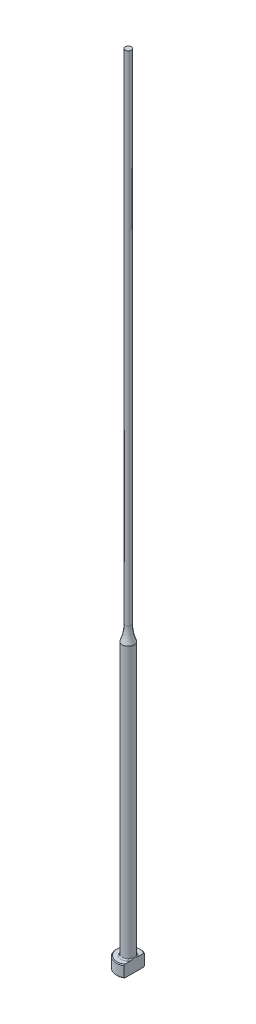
ISO-10303-21;
HEADER;
FILE_DESCRIPTION(('STEP AP214'),'2;1');
FILE_NAME('part.step','',(''),(''),'','','');
FILE_SCHEMA(('AUTOMOTIVE_DESIGN { 1 0 10303 214 1 1 1 1 }'));
ENDSEC;
DATA;
#1=APPLICATION_CONTEXT('core data for automotive mechanical design processes');
#2=APPLICATION_PROTOCOL_DEFINITION('international standard','automotive_design',2000,#1);
#3=PRODUCT_CONTEXT('',#1,'mechanical');
#4=PRODUCT('Part','Part','',(#3));
#5=PRODUCT_RELATED_PRODUCT_CATEGORY('part','',(#4));
#6=PRODUCT_DEFINITION_FORMATION('','',#4);
#7=PRODUCT_DEFINITION_CONTEXT('part definition',#1,'design');
#8=PRODUCT_DEFINITION('design','',#6,#7);
#9=PRODUCT_DEFINITION_SHAPE('','',#8);
#10=(LENGTH_UNIT() NAMED_UNIT(*) SI_UNIT(.MILLI.,.METRE.));
#11=(NAMED_UNIT(*) PLANE_ANGLE_UNIT() SI_UNIT($,.RADIAN.));
#12=(NAMED_UNIT(*) SI_UNIT($,.STERADIAN.) SOLID_ANGLE_UNIT());
#13=UNCERTAINTY_MEASURE_WITH_UNIT(LENGTH_MEASURE(1.E-05),#10,'distance_accuracy_value','');
#14=(GEOMETRIC_REPRESENTATION_CONTEXT(3) GLOBAL_UNCERTAINTY_ASSIGNED_CONTEXT((#13)) GLOBAL_UNIT_ASSIGNED_CONTEXT((#10,
#11,#12)) REPRESENTATION_CONTEXT('',''));
#15=CARTESIAN_POINT('',(0.,0.,0.));
#16=DIRECTION('',(0.,0.,1.));
#17=DIRECTION('',(1.,0.,0.));
#18=AXIS2_PLACEMENT_3D('',#15,#16,#17);
#19=CARTESIAN_POINT('',(-2.99999999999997,3.,0.));
#20=DIRECTION('',(0.,1.,0.));
#21=DIRECTION('',(0.,0.,1.));
#22=AXIS2_PLACEMENT_3D('',#19,#20,#21);
#23=PLANE('',#22);
#24=CARTESIAN_POINT('',(0.,3.,0.));
#25=DIRECTION('',(0.,1.,0.));
#26=DIRECTION('',(0.,0.,1.));
#27=AXIS2_PLACEMENT_3D('',#24,#25,#26);
#28=CIRCLE('',#27,2.79999999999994);
#29=CARTESIAN_POINT('',(1.49999999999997,3.,-2.36431808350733));
#30=VERTEX_POINT('',#29);
#31=CARTESIAN_POINT('',(1.49999999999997,3.,2.36431808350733));
#32=VERTEX_POINT('',#31);
#33=EDGE_CURVE('E187',#30,#32,#28,.T.);
#34=ORIENTED_EDGE('',*,*,#33,.T.);
#35=DIRECTION('',(0.,0.,-1.));
#36=VECTOR('',#35,1.);
#37=CARTESIAN_POINT('',(1.49999999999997,3.,0.));
#38=LINE('',#37,#36);
#39=CARTESIAN_POINT('',(1.49999999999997,3.00000000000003,0.99498743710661));
#40=VERTEX_POINT('',#39);
#41=EDGE_CURVE('E57',#32,#40,#38,.T.);
#42=ORIENTED_EDGE('',*,*,#41,.T.);
#43=CARTESIAN_POINT('',(0.,3.,0.));
#44=DIRECTION('',(0.,1.,0.));
#45=DIRECTION('',(0.,0.,1.));
#46=AXIS2_PLACEMENT_3D('',#43,#44,#45);
#47=CIRCLE('',#46,1.79999999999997);
#48=CARTESIAN_POINT('',(1.49999999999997,3.00000000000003,-0.994987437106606));
#49=VERTEX_POINT('',#48);
#50=EDGE_CURVE('E108',#40,#49,#47,.F.);
#51=ORIENTED_EDGE('',*,*,#50,.T.);
#52=EDGE_CURVE('E137',#49,#30,#38,.T.);
#53=ORIENTED_EDGE('',*,*,#52,.T.);
#54=EDGE_LOOP('',(#34,#42,#51,#53));
#55=FACE_BOUND('',#54,.T.);
#56=ADVANCED_FACE('F32',(#55),#23,.T.);
#57=CARTESIAN_POINT('',(0.,259.958771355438,0.));
#58=DIRECTION('',(0.,1.,0.));
#59=DIRECTION('',(0.,0.,1.));
#60=AXIS2_PLACEMENT_3D('',#57,#58,#59);
#61=CYLINDRICAL_SURFACE('',#60,2.99999999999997);
#62=CARTESIAN_POINT('',(0.,2.79999999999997,0.));
#63=DIRECTION('',(0.,1.,0.));
#64=DIRECTION('',(0.,0.,1.));
#65=AXIS2_PLACEMENT_3D('',#62,#63,#64);
#66=CIRCLE('',#65,2.99999999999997);
#67=CARTESIAN_POINT('',(1.49999999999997,2.79999999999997,2.5980762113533));
#68=VERTEX_POINT('',#67);
#69=CARTESIAN_POINT('',(1.49999999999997,2.79999999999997,-2.5980762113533));
#70=VERTEX_POINT('',#69);
#71=EDGE_CURVE('E105',#68,#70,#66,.F.);
#72=ORIENTED_EDGE('',*,*,#71,.T.);
#73=DIRECTION('',(0.,-1.,0.));
#74=VECTOR('',#73,1.);
#75=CARTESIAN_POINT('',(1.49999999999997,200.,-2.5980762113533));
#76=LINE('',#75,#74);
#77=CARTESIAN_POINT('',(1.49999999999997,0.200000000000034,-2.5980762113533));
#78=VERTEX_POINT('',#77);
#79=EDGE_CURVE('E193',#70,#78,#76,.T.);
#80=ORIENTED_EDGE('',*,*,#79,.T.);
#81=CARTESIAN_POINT('',(0.,0.200000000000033,0.));
#82=DIRECTION('',(0.,-1.,0.));
#83=DIRECTION('',(0.,0.,-1.));
#84=AXIS2_PLACEMENT_3D('',#81,#82,#83);
#85=CIRCLE('',#84,2.99999999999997);
#86=CARTESIAN_POINT('',(1.49999999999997,0.200000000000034,2.5980762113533));
#87=VERTEX_POINT('',#86);
#88=EDGE_CURVE('E100',#78,#87,#85,.F.);
#89=ORIENTED_EDGE('',*,*,#88,.T.);
#90=DIRECTION('',(0.,-1.,0.));
#91=VECTOR('',#90,1.);
#92=CARTESIAN_POINT('',(1.49999999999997,200.,2.5980762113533));
#93=LINE('',#92,#91);
#94=EDGE_CURVE('E93',#68,#87,#93,.T.);
#95=ORIENTED_EDGE('',*,*,#94,.F.);
#96=EDGE_LOOP('',(#72,#80,#89,#95));
#97=FACE_BOUND('',#96,.T.);
#98=ADVANCED_FACE('F158',(#97),#61,.T.);
#99=CARTESIAN_POINT('',(0.,0.,0.));
#100=DIRECTION('',(0.,-1.,0.));
#101=DIRECTION('',(0.,0.,-1.));
#102=AXIS2_PLACEMENT_3D('',#99,#100,#101);
#103=PLANE('',#102);
#104=CARTESIAN_POINT('',(0.,0.,0.));
#105=DIRECTION('',(0.,-1.,0.));
#106=DIRECTION('',(0.,0.,-1.));
#107=AXIS2_PLACEMENT_3D('',#104,#105,#106);
#108=CIRCLE('',#107,2.79999999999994);
#109=CARTESIAN_POINT('',(1.49999999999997,0.,2.36431808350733));
#110=VERTEX_POINT('',#109);
#111=CARTESIAN_POINT('',(1.49999999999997,0.,-2.36431808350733));
#112=VERTEX_POINT('',#111);
#113=EDGE_CURVE('E98',#110,#112,#108,.T.);
#114=ORIENTED_EDGE('',*,*,#113,.T.);
#115=DIRECTION('',(0.,0.,1.));
#116=VECTOR('',#115,1.);
#117=CARTESIAN_POINT('',(1.49999999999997,0.,-2.5980762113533));
#118=LINE('',#117,#116);
#119=EDGE_CURVE('E83',#112,#110,#118,.T.);
#120=ORIENTED_EDGE('',*,*,#119,.T.);
#121=EDGE_LOOP('',(#114,#120));
#122=FACE_BOUND('',#121,.T.);
#123=ADVANCED_FACE('F103',(#122),#103,.T.);
#124=CARTESIAN_POINT('',(0.,3.,0.));
#125=DIRECTION('',(0.,-1.,0.));
#126=DIRECTION('',(0.,0.,-1.));
#127=AXIS2_PLACEMENT_3D('',#124,#125,#126);
#128=CONICAL_SURFACE('',#127,2.79999999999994,0.785398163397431);
#129=ORIENTED_EDGE('',*,*,#71,.F.);
#130=CARTESIAN_POINT('',(1.49999999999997,-0.11174109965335,5.71827621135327));
#131=CARTESIAN_POINT('',(1.49999999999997,0.0136183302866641,5.58866816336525));
#132=CARTESIAN_POINT('',(1.49999999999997,0.138843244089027,5.45892957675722));
#133=CARTESIAN_POINT('',(1.49999999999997,0.388944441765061,5.19911365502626));
#134=CARTESIAN_POINT('',(1.49999999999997,0.513820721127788,5.06903631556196));
#135=CARTESIAN_POINT('',(1.49999999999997,0.763205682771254,4.80840180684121));
#136=CARTESIAN_POINT('',(1.49999999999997,0.887714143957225,4.67784442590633));
#137=CARTESIAN_POINT('',(1.49999999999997,1.13618059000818,4.4162081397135));
#138=CARTESIAN_POINT('',(1.49999999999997,1.26013857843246,4.28512923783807));
#139=CARTESIAN_POINT('',(1.49999999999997,1.50488975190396,4.02490837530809));
#140=CARTESIAN_POINT('',(1.49999999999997,1.62569693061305,3.8957795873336));
#141=CARTESIAN_POINT('',(1.49999999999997,1.86640694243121,3.63668213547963));
#142=CARTESIAN_POINT('',(1.49999999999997,1.98630978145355,3.50671347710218));
#143=CARTESIAN_POINT('',(1.49999999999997,2.2248603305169,3.24567921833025));
#144=CARTESIAN_POINT('',(1.49999999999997,2.3435083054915,3.11461386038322));
#145=CARTESIAN_POINT('',(1.49999999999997,2.5790771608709,2.85094268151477));
#146=CARTESIAN_POINT('',(1.49999999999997,2.69599811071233,2.71833692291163));
#147=CARTESIAN_POINT('',(1.49999999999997,2.88262371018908,2.50255231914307));
#148=CARTESIAN_POINT('',(1.49999999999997,2.95312454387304,2.42006293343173));
#149=CARTESIAN_POINT('',(1.49999999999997,3.09287098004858,2.25401084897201));
#150=CARTESIAN_POINT('',(1.49999999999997,3.16211645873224,2.17044804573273));
#151=CARTESIAN_POINT('',(1.49999999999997,3.29964684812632,2.00105967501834));
#152=CARTESIAN_POINT('',(1.49999999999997,3.36791386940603,1.9152195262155));
#153=CARTESIAN_POINT('',(1.49999999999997,3.50205840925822,1.7417139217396));
#154=CARTESIAN_POINT('',(1.49999999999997,3.56793649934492,1.65404891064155));
#155=CARTESIAN_POINT('',(1.49999999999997,3.69728151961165,1.47490236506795));
#156=CARTESIAN_POINT('',(1.49999999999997,3.76069661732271,1.38338308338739));
#157=CARTESIAN_POINT('',(1.49999999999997,3.88239539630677,1.19675661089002));
#158=CARTESIAN_POINT('',(1.49999999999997,3.94067201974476,1.10164473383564));
#159=CARTESIAN_POINT('',(1.49999999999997,4.048413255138,0.908008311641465));
#160=CARTESIAN_POINT('',(1.49999999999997,4.09797809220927,0.809540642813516));
#161=CARTESIAN_POINT('',(1.49999999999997,4.18432188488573,0.60719295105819));
#162=CARTESIAN_POINT('',(1.49999999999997,4.22114374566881,0.503332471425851));
#163=CARTESIAN_POINT('',(1.49999999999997,4.26099935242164,0.3475775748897));
#164=CARTESIAN_POINT('',(1.49999999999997,4.2715702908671,0.297609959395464));
#165=CARTESIAN_POINT('',(1.49999999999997,4.28794860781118,0.196885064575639));
#166=CARTESIAN_POINT('',(1.49999999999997,4.29375640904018,0.146127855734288));
#167=CARTESIAN_POINT('',(1.49999999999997,4.30019707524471,0.0444388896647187));
#168=CARTESIAN_POINT('',(1.49999999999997,4.30084594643,-0.00649183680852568));
#169=CARTESIAN_POINT('',(1.49999999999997,4.29696416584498,-0.108155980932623));
#170=CARTESIAN_POINT('',(1.49999999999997,4.29243308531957,-0.158889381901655));
#171=CARTESIAN_POINT('',(1.49999999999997,4.27856915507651,-0.259234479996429));
#172=CARTESIAN_POINT('',(1.49999999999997,4.2692782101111,-0.308852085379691));
#173=CARTESIAN_POINT('',(1.49999999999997,4.24647108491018,-0.407110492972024));
#174=CARTESIAN_POINT('',(1.49999999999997,4.23295324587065,-0.45575090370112));
#175=CARTESIAN_POINT('',(1.49999999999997,4.20226175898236,-0.55214996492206));
#176=CARTESIAN_POINT('',(1.49999999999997,4.18506801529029,-0.599902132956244));
#177=CARTESIAN_POINT('',(1.49999999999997,4.14771387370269,-0.694205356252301));
#178=CARTESIAN_POINT('',(1.49999999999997,4.12755408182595,-0.740756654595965));
#179=CARTESIAN_POINT('',(1.49999999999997,4.0632769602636,-0.879166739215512));
#180=CARTESIAN_POINT('',(1.49999999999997,4.01551721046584,-0.969329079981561));
#181=CARTESIAN_POINT('',(1.49999999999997,3.91367909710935,-1.14604316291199));
#182=CARTESIAN_POINT('',(1.49999999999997,3.85959300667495,-1.2325903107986));
#183=CARTESIAN_POINT('',(1.49999999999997,3.74697968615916,-1.40321348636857));
#184=CARTESIAN_POINT('',(1.49999999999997,3.68843573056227,-1.4872783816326));
#185=CARTESIAN_POINT('',(1.49999999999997,3.5684384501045,-1.65322187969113));
#186=CARTESIAN_POINT('',(1.49999999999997,3.50698656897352,-1.73510153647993));
#187=CARTESIAN_POINT('',(1.49999999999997,3.3811567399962,-1.89829823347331));
#188=CARTESIAN_POINT('',(1.49999999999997,3.31675092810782,-1.97959369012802));
#189=CARTESIAN_POINT('',(1.49999999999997,3.18634068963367,-2.14090082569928));
#190=CARTESIAN_POINT('',(1.49999999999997,3.12033609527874,-2.22091236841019));
#191=CARTESIAN_POINT('',(1.49999999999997,2.92086431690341,-2.45906508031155));
#192=CARTESIAN_POINT('',(1.49999999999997,2.78562663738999,-2.61572090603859));
#193=CARTESIAN_POINT('',(1.49999999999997,2.53554498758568,-2.90006295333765));
#194=CARTESIAN_POINT('',(1.49999999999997,2.42114543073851,-3.02814382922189));
#195=CARTESIAN_POINT('',(1.49999999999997,2.1909355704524,-3.28303767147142));
#196=CARTESIAN_POINT('',(1.49999999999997,2.07512522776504,-3.40985060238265));
#197=CARTESIAN_POINT('',(1.49999999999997,1.72597067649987,-3.78913849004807));
#198=CARTESIAN_POINT('',(1.49999999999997,1.49111760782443,-4.04022177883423));
#199=CARTESIAN_POINT('',(1.49999999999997,1.0288247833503,-4.52992803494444));
#200=CARTESIAN_POINT('',(1.49999999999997,0.801477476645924,-4.76863870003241));
#201=CARTESIAN_POINT('',(1.49999999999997,0.459548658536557,-5.12558036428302));
#202=CARTESIAN_POINT('',(1.49999999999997,0.345484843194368,-5.24430773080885));
#203=CARTESIAN_POINT('',(1.49999999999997,0.117071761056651,-5.48148573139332));
#204=CARTESIAN_POINT('',(1.49999999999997,0.00272249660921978,-5.59993636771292));
#205=CARTESIAN_POINT('',(1.49999999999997,-0.11174109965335,-5.71827621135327));
#206=B_SPLINE_CURVE_WITH_KNOTS('',3,(#130,#131,#132,#133,#134,#135,#136,#137,#138,#139,#140,
#141,#142,#143,#144,#145,#146,#147,#148,#149,#150,#151,#152,#153,#154,#155,#156,#157,#158,#159,
#160,#161,#162,#163,#164,#165,#166,#167,#168,#169,#170,#171,#172,#173,#174,#175,#176,#177,#178,
#179,#180,#181,#182,#183,#184,#185,#186,#187,#188,#189,#190,#191,#192,#193,#194,#195,#196,#197,
#198,#199,#200,#201,#202,#203,#204,#205),.UNSPECIFIED.,.F.,.F.,(4,2,2,2,2,2,2,2,2,2,2,2,2,2,2,2,
2,2,2,2,2,2,2,2,2,2,2,2,2,2,2,2,2,2,2,2,2,4),(0.,0.540943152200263,1.08189327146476,
1.62312052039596,2.16434426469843,2.69482920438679,3.22531067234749,3.75567781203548,
4.28602356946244,4.61155053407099,4.9371094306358,5.26610945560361,5.59503024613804,
5.92894782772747,6.26331713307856,6.59354403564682,6.92264800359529,7.07567478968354,
7.2286879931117,7.38122626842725,7.53377717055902,7.6850075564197,7.83629736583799,
7.98843643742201,8.14054446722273,8.44618799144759,8.75220879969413,9.05944044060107,
9.3665211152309,9.6776428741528,9.98879742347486,10.609592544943,11.1247803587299,
11.6399825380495,12.6713544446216,13.6603005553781,14.1542238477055,14.6481430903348),.UNSPECIFIED.);
#207=EDGE_CURVE('E136',#68,#32,#206,.T.);
#208=ORIENTED_EDGE('',*,*,#207,.T.);
#209=ORIENTED_EDGE('',*,*,#33,.F.);
#210=EDGE_CURVE('E128',#30,#70,#206,.T.);
#211=ORIENTED_EDGE('',*,*,#210,.T.);
#212=EDGE_LOOP('',(#129,#208,#209,#211));
#213=FACE_BOUND('',#212,.T.);
#214=ADVANCED_FACE('F144',(#213),#128,.T.);
#215=CARTESIAN_POINT('',(0.,0.200000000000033,0.));
#216=DIRECTION('',(0.,1.,0.));
#217=DIRECTION('',(0.,0.,1.));
#218=AXIS2_PLACEMENT_3D('',#215,#216,#217);
#219=CONICAL_SURFACE('',#218,2.99999999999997,0.785398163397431);
#220=ORIENTED_EDGE('',*,*,#88,.F.);
#221=CARTESIAN_POINT('',(1.49999999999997,3.11174109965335,-5.71827621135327));
#222=CARTESIAN_POINT('',(1.49999999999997,2.98638166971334,-5.58866816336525));
#223=CARTESIAN_POINT('',(1.49999999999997,2.86115675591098,-5.45892957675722));
#224=CARTESIAN_POINT('',(1.49999999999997,2.61105555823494,-5.19911365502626));
#225=CARTESIAN_POINT('',(1.49999999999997,2.48617927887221,-5.06903631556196));
#226=CARTESIAN_POINT('',(1.49999999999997,2.23679431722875,-4.80840180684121));
#227=CARTESIAN_POINT('',(1.49999999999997,2.11228585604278,-4.67784442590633));
#228=CARTESIAN_POINT('',(1.49999999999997,1.86381940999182,-4.4162081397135));
#229=CARTESIAN_POINT('',(1.49999999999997,1.73986142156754,-4.28512923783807));
#230=CARTESIAN_POINT('',(1.49999999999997,1.49511024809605,-4.02490837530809));
#231=CARTESIAN_POINT('',(1.49999999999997,1.37430306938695,-3.8957795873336));
#232=CARTESIAN_POINT('',(1.49999999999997,1.13359305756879,-3.63668213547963));
#233=CARTESIAN_POINT('',(1.49999999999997,1.01369021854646,-3.50671347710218));
#234=CARTESIAN_POINT('',(1.49999999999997,0.775139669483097,-3.24567921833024));
#235=CARTESIAN_POINT('',(1.49999999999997,0.656491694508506,-3.11461386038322));
#236=CARTESIAN_POINT('',(1.49999999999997,0.420922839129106,-2.85094268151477));
#237=CARTESIAN_POINT('',(1.49999999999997,0.304001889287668,-2.71833692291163));
#238=CARTESIAN_POINT('',(1.49999999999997,0.117376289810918,-2.50255231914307));
#239=CARTESIAN_POINT('',(1.49999999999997,0.0468754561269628,-2.42006293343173));
#240=CARTESIAN_POINT('',(1.49999999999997,-0.0928709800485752,-2.254010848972));
#241=CARTESIAN_POINT('',(1.49999999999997,-0.162116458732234,-2.17044804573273));
#242=CARTESIAN_POINT('',(1.49999999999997,-0.299646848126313,-2.00105967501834));
#243=CARTESIAN_POINT('',(1.49999999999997,-0.367913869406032,-1.9152195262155));
#244=CARTESIAN_POINT('',(1.49999999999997,-0.502058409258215,-1.7417139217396));
#245=CARTESIAN_POINT('',(1.49999999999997,-0.567936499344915,-1.65404891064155));
#246=CARTESIAN_POINT('',(1.49999999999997,-0.697281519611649,-1.47490236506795));
#247=CARTESIAN_POINT('',(1.49999999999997,-0.760696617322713,-1.38338308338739));
#248=CARTESIAN_POINT('',(1.49999999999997,-0.882395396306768,-1.19675661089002));
#249=CARTESIAN_POINT('',(1.49999999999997,-0.940672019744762,-1.10164473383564));
#250=CARTESIAN_POINT('',(1.49999999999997,-1.04841325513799,-0.908008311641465));
#251=CARTESIAN_POINT('',(1.49999999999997,-1.09797809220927,-0.809540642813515));
#252=CARTESIAN_POINT('',(1.49999999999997,-1.18432188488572,-0.607192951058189));
#253=CARTESIAN_POINT('',(1.49999999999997,-1.22114374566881,-0.503332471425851));
#254=CARTESIAN_POINT('',(1.49999999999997,-1.26099935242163,-0.3475775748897));
#255=CARTESIAN_POINT('',(1.49999999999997,-1.2715702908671,-0.297609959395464));
#256=CARTESIAN_POINT('',(1.49999999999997,-1.28794860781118,-0.19688506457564));
#257=CARTESIAN_POINT('',(1.49999999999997,-1.29375640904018,-0.146127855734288));
#258=CARTESIAN_POINT('',(1.49999999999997,-1.30019707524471,-0.0444388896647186));
#259=CARTESIAN_POINT('',(1.49999999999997,-1.30084594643,0.00649183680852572));
#260=CARTESIAN_POINT('',(1.49999999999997,-1.29696416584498,0.108155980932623));
#261=CARTESIAN_POINT('',(1.49999999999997,-1.29243308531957,0.158889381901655));
#262=CARTESIAN_POINT('',(1.49999999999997,-1.2785691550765,0.259234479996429));
#263=CARTESIAN_POINT('',(1.49999999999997,-1.2692782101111,0.308852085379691));
#264=CARTESIAN_POINT('',(1.49999999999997,-1.24647108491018,0.407110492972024));
#265=CARTESIAN_POINT('',(1.49999999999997,-1.23295324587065,0.45575090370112));
#266=CARTESIAN_POINT('',(1.49999999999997,-1.20226175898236,0.55214996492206));
#267=CARTESIAN_POINT('',(1.49999999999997,-1.18506801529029,0.599902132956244));
#268=CARTESIAN_POINT('',(1.49999999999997,-1.14771387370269,0.694205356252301));
#269=CARTESIAN_POINT('',(1.49999999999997,-1.12755408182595,0.740756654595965));
#270=CARTESIAN_POINT('',(1.49999999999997,-1.0632769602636,0.879166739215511));
#271=CARTESIAN_POINT('',(1.49999999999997,-1.01551721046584,0.96932907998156));
#272=CARTESIAN_POINT('',(1.49999999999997,-0.913679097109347,1.14604316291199));
#273=CARTESIAN_POINT('',(1.49999999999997,-0.85959300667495,1.2325903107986));
#274=CARTESIAN_POINT('',(1.49999999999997,-0.74697968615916,1.40321348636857));
#275=CARTESIAN_POINT('',(1.49999999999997,-0.688435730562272,1.4872783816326));
#276=CARTESIAN_POINT('',(1.49999999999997,-0.568438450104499,1.65322187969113));
#277=CARTESIAN_POINT('',(1.49999999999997,-0.50698656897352,1.73510153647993));
#278=CARTESIAN_POINT('',(1.49999999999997,-0.381156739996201,1.89829823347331));
#279=CARTESIAN_POINT('',(1.49999999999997,-0.316750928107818,1.97959369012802));
#280=CARTESIAN_POINT('',(1.49999999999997,-0.186340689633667,2.14090082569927));
#281=CARTESIAN_POINT('',(1.49999999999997,-0.120336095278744,2.22091236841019));
#282=CARTESIAN_POINT('',(1.49999999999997,0.0791356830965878,2.45906508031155));
#283=CARTESIAN_POINT('',(1.49999999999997,0.214373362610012,2.61572090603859));
#284=CARTESIAN_POINT('',(1.49999999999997,0.464455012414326,2.90006295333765));
#285=CARTESIAN_POINT('',(1.49999999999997,0.578854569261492,3.02814382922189));
#286=CARTESIAN_POINT('',(1.49999999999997,0.809064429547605,3.28303767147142));
#287=CARTESIAN_POINT('',(1.49999999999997,0.924874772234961,3.40985060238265));
#288=CARTESIAN_POINT('',(1.49999999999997,1.27402932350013,3.78913849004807));
#289=CARTESIAN_POINT('',(1.49999999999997,1.50888239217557,4.04022177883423));
#290=CARTESIAN_POINT('',(1.49999999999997,1.97117521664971,4.52992803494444));
#291=CARTESIAN_POINT('',(1.49999999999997,2.19852252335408,4.76863870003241));
#292=CARTESIAN_POINT('',(1.49999999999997,2.54045134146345,5.12558036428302));
#293=CARTESIAN_POINT('',(1.49999999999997,2.65451515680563,5.24430773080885));
#294=CARTESIAN_POINT('',(1.49999999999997,2.88292823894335,5.48148573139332));
#295=CARTESIAN_POINT('',(1.49999999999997,2.99727750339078,5.59993636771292));
#296=CARTESIAN_POINT('',(1.49999999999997,3.11174109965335,5.71827621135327));
#297=B_SPLINE_CURVE_WITH_KNOTS('',3,(#221,#222,#223,#224,#225,#226,#227,#228,#229,#230,#231,
#232,#233,#234,#235,#236,#237,#238,#239,#240,#241,#242,#243,#244,#245,#246,#247,#248,#249,#250,
#251,#252,#253,#254,#255,#256,#257,#258,#259,#260,#261,#262,#263,#264,#265,#266,#267,#268,#269,
#270,#271,#272,#273,#274,#275,#276,#277,#278,#279,#280,#281,#282,#283,#284,#285,#286,#287,#288,
#289,#290,#291,#292,#293,#294,#295,#296),.UNSPECIFIED.,.F.,.F.,(4,2,2,2,2,2,2,2,2,2,2,2,2,2,2,2,
2,2,2,2,2,2,2,2,2,2,2,2,2,2,2,2,2,2,2,2,2,4),(0.,0.540943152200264,1.08189327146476,
1.62312052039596,2.16434426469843,2.69482920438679,3.22531067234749,3.75567781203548,
4.28602356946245,4.611550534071,4.9371094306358,5.26610945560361,5.59503024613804,
5.92894782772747,6.26331713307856,6.59354403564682,6.92264800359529,7.07567478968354,
7.2286879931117,7.38122626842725,7.53377717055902,7.6850075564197,7.83629736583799,
7.98843643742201,8.14054446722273,8.44618799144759,8.75220879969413,9.05944044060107,
9.3665211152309,9.6776428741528,9.98879742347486,10.609592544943,11.1247803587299,
11.6399825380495,12.6713544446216,13.6603005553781,14.1542238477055,14.6481430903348),.UNSPECIFIED.);
#298=EDGE_CURVE('E86',#78,#112,#297,.T.);
#299=ORIENTED_EDGE('',*,*,#298,.T.);
#300=ORIENTED_EDGE('',*,*,#113,.F.);
#301=EDGE_CURVE('E89',#110,#87,#297,.T.);
#302=ORIENTED_EDGE('',*,*,#301,.T.);
#303=EDGE_LOOP('',(#220,#299,#300,#302));
#304=FACE_BOUND('',#303,.T.);
#305=ADVANCED_FACE('F97',(#304),#219,.T.);
#306=CARTESIAN_POINT('',(0.,3.30000000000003,0.));
#307=DIRECTION('',(0.,1.,0.));
#308=DIRECTION('',(0.,0.,1.));
#309=AXIS2_PLACEMENT_3D('',#306,#307,#308);
#310=TOROIDAL_SURFACE('',#309,1.79999999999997,0.3);
#311=CARTESIAN_POINT('',(1.49999999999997,3.30000000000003,0.));
#312=CARTESIAN_POINT('',(1.49999999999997,3.300000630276,3.41555678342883E-12));
#313=CARTESIAN_POINT('',(1.49999999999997,3.30000126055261,-1.15373640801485E-07));
#314=CARTESIAN_POINT('',(1.49999999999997,3.3000024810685,-4.90631575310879E-07));
#315=CARTESIAN_POINT('',(1.49999999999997,3.30000307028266,-7.53296670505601E-07));
#316=CARTESIAN_POINT('',(1.49999999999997,3.30000424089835,-1.38757096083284E-06));
#317=CARTESIAN_POINT('',(1.49999999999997,3.300004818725,-1.76563001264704E-06));
#318=CARTESIAN_POINT('',(1.49999999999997,3.30000591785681,-2.58768006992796E-06));
#319=CARTESIAN_POINT('',(1.49999999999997,3.30000643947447,-3.03127014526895E-06));
#320=CARTESIAN_POINT('',(1.49999999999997,3.30000815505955,-4.60021967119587E-06));
#321=CARTESIAN_POINT('',(1.49999999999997,3.30000927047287,-5.8124152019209E-06));
#322=CARTESIAN_POINT('',(1.49999999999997,3.30001128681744,-8.33989413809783E-06));
#323=CARTESIAN_POINT('',(1.49999999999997,3.30001219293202,-9.65128157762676E-06));
#324=CARTESIAN_POINT('',(1.49999999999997,3.30001551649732,-1.46782505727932E-05));
#325=CARTESIAN_POINT('',(1.49999999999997,3.30001775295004,-1.8517976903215E-05));
#326=CARTESIAN_POINT('',(1.49999999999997,3.30002148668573,-2.61616194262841E-05));
#327=CARTESIAN_POINT('',(1.49999999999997,3.30002302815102,-2.99447742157E-05));
#328=CARTESIAN_POINT('',(1.49999999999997,3.30002943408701,-4.58003743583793E-05));
#329=CARTESIAN_POINT('',(1.49999999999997,3.3000341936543,-5.79079078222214E-05));
#330=CARTESIAN_POINT('',(1.49999999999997,3.30004197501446,-8.07263755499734E-05));
#331=CARTESIAN_POINT('',(1.49999999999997,3.30004514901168,-9.13834709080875E-05));
#332=CARTESIAN_POINT('',(1.49999999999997,3.30006989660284,-0.000167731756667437));
#333=CARTESIAN_POINT('',(1.49999999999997,3.30010092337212,-0.000229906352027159));
#334=CARTESIAN_POINT('',(1.49999999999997,3.30021632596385,-0.000470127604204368));
#335=CARTESIAN_POINT('',(1.49999999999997,3.30029368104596,-0.000650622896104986));
#336=CARTESIAN_POINT('',(1.49999999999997,3.30059619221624,-0.00134589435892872));
#337=CARTESIAN_POINT('',(1.49999999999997,3.30082870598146,-0.00185814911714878));
#338=CARTESIAN_POINT('',(1.49999999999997,3.30176696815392,-0.00393547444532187));
#339=CARTESIAN_POINT('',(1.49999999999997,3.30246445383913,-0.00550332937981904));
#340=CARTESIAN_POINT('',(1.49999999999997,3.31426785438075,-0.0320229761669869));
#341=CARTESIAN_POINT('',(1.49999999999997,3.32544800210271,-0.0569503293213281));
#342=CARTESIAN_POINT('',(1.49999999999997,3.34725700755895,-0.105984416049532));
#343=CARTESIAN_POINT('',(1.49999999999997,3.35789134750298,-0.130088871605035));
#344=CARTESIAN_POINT('',(1.49999999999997,3.38015321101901,-0.181096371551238));
#345=CARTESIAN_POINT('',(1.49999999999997,3.39175804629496,-0.208009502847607));
#346=CARTESIAN_POINT('',(1.49999999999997,3.41469034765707,-0.262264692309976));
#347=CARTESIAN_POINT('',(1.49999999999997,3.42601398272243,-0.289608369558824));
#348=CARTESIAN_POINT('',(1.49999999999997,3.45363212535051,-0.35820378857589));
#349=CARTESIAN_POINT('',(1.49999999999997,3.46959026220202,-0.39959288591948));
#350=CARTESIAN_POINT('',(1.49999999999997,3.49940505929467,-0.482097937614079));
#351=CARTESIAN_POINT('',(1.49999999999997,3.51330033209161,-0.523199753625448));
#352=CARTESIAN_POINT('',(1.49999999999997,3.53552507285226,-0.595497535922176));
#353=CARTESIAN_POINT('',(1.49999999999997,3.54436834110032,-0.626532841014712));
#354=CARTESIAN_POINT('',(1.49999999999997,3.56052427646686,-0.6891760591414));
#355=CARTESIAN_POINT('',(1.49999999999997,3.5678279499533,-0.720786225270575));
#356=CARTESIAN_POINT('',(1.49999999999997,3.5875075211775,-0.819524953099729));
#357=CARTESIAN_POINT('',(1.49999999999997,3.59661044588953,-0.88742909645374));
#358=CARTESIAN_POINT('',(1.49999999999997,3.60059842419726,-0.991180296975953));
#359=CARTESIAN_POINT('',(1.49999999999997,3.60019840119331,-1.02684364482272));
#360=CARTESIAN_POINT('',(1.49999999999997,3.59497085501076,-1.097505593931));
#361=CARTESIAN_POINT('',(1.49999999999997,3.59019295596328,-1.13250716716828));
#362=CARTESIAN_POINT('',(1.49999999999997,3.57687734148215,-1.19353096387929));
#363=CARTESIAN_POINT('',(1.49999999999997,3.56943875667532,-1.21978854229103));
#364=CARTESIAN_POINT('',(1.49999999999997,3.55063748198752,-1.27094658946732));
#365=CARTESIAN_POINT('',(1.49999999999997,3.53927342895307,-1.29584658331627));
#366=CARTESIAN_POINT('',(1.49999999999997,3.51660016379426,-1.33501873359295));
#367=CARTESIAN_POINT('',(1.49999999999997,3.50657738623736,-1.35003296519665));
#368=CARTESIAN_POINT('',(1.49999999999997,3.48437469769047,-1.37837252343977));
#369=CARTESIAN_POINT('',(1.49999999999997,3.47219867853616,-1.39170082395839));
#370=CARTESIAN_POINT('',(1.49999999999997,3.44835614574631,-1.41349417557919));
#371=CARTESIAN_POINT('',(1.49999999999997,3.43709185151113,-1.42239673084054));
#372=CARTESIAN_POINT('',(1.49999999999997,3.41325256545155,-1.43825467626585));
#373=CARTESIAN_POINT('',(1.49999999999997,3.40067804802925,-1.44521076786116));
#374=CARTESIAN_POINT('',(1.49999999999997,3.37433767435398,-1.45677158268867));
#375=CARTESIAN_POINT('',(1.49999999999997,3.36056203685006,-1.46135438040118));
#376=CARTESIAN_POINT('',(1.49999999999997,3.33237324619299,-1.46767730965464));
#377=CARTESIAN_POINT('',(1.49999999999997,3.31796076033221,-1.46942034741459));
#378=CARTESIAN_POINT('',(1.49999999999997,3.29122479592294,-1.4698720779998));
#379=CARTESIAN_POINT('',(1.49999999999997,3.27890664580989,-1.468990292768));
#380=CARTESIAN_POINT('',(1.49999999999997,3.25461019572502,-1.4651157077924));
#381=CARTESIAN_POINT('',(1.49999999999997,3.2426318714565,-1.46212305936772));
#382=CARTESIAN_POINT('',(1.49999999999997,3.21959683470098,-1.4543117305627));
#383=CARTESIAN_POINT('',(1.49999999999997,3.20852542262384,-1.44953579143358));
#384=CARTESIAN_POINT('',(1.49999999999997,3.18721125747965,-1.43840957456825));
#385=CARTESIAN_POINT('',(1.49999999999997,3.1769687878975,-1.43205876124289));
#386=CARTESIAN_POINT('',(1.49999999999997,3.15325976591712,-1.41506353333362));
#387=CARTESIAN_POINT('',(1.49999999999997,3.14027750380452,-1.40374235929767));
#388=CARTESIAN_POINT('',(1.49999999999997,3.11630720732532,-1.37914825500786));
#389=CARTESIAN_POINT('',(1.49999999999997,3.10532420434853,-1.36587054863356));
#390=CARTESIAN_POINT('',(1.49999999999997,3.08100891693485,-1.33197272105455));
#391=CARTESIAN_POINT('',(1.49999999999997,3.06867625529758,-1.31063843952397));
#392=CARTESIAN_POINT('',(1.49999999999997,3.04751867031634,-1.26637455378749));
#393=CARTESIAN_POINT('',(1.49999999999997,3.03869240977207,-1.24344556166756));
#394=CARTESIAN_POINT('',(1.49999999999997,3.01978360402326,-1.18316534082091));
#395=CARTESIAN_POINT('',(1.49999999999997,3.01191472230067,-1.14512623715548));
#396=CARTESIAN_POINT('',(1.49999999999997,3.00188285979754,-1.06789971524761));
#397=CARTESIAN_POINT('',(1.49999999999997,2.99979735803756,-1.02870374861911));
#398=CARTESIAN_POINT('',(1.49999999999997,3.00021727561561,-0.953160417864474));
#399=CARTESIAN_POINT('',(1.49999999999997,3.00240673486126,-0.916808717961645));
#400=CARTESIAN_POINT('',(1.49999999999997,3.0099643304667,-0.844432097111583));
#401=CARTESIAN_POINT('',(1.49999999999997,3.01533462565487,-0.808407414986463));
#402=CARTESIAN_POINT('',(1.49999999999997,3.02828086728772,-0.738670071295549));
#403=CARTESIAN_POINT('',(1.49999999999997,3.03573028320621,-0.704933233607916));
#404=CARTESIAN_POINT('',(1.49999999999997,3.05243174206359,-0.638128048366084));
#405=CARTESIAN_POINT('',(1.49999999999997,3.06167285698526,-0.605056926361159));
#406=CARTESIAN_POINT('',(1.49999999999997,3.08440652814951,-0.53019513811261));
#407=CARTESIAN_POINT('',(1.49999999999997,3.09836576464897,-0.488547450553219));
#408=CARTESIAN_POINT('',(1.49999999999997,3.1283820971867,-0.404954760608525));
#409=CARTESIAN_POINT('',(1.49999999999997,3.14447968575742,-0.363024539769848));
#410=CARTESIAN_POINT('',(1.49999999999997,3.17238454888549,-0.293508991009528));
#411=CARTESIAN_POINT('',(1.49999999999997,3.18384249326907,-0.265781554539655));
#412=CARTESIAN_POINT('',(1.49999999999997,3.20705854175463,-0.210769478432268));
#413=CARTESIAN_POINT('',(1.49999999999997,3.21881265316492,-0.183483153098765));
#414=CARTESIAN_POINT('',(1.49999999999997,3.24136702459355,-0.131772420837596));
#415=CARTESIAN_POINT('',(1.49999999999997,3.25214361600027,-0.107337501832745));
#416=CARTESIAN_POINT('',(1.49999999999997,3.27424746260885,-0.0576321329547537));
#417=CARTESIAN_POINT('',(1.49999999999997,3.28558038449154,-0.0323640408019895));
#418=CARTESIAN_POINT('',(1.49999999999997,3.29753556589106,-0.00550327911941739));
#419=CARTESIAN_POINT('',(1.49999999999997,3.29823307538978,-0.00393537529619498));
#420=CARTESIAN_POINT('',(1.49999999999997,3.29917134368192,-0.00185803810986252));
#421=CARTESIAN_POINT('',(1.49999999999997,3.29940384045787,-0.00134582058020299));
#422=CARTESIAN_POINT('',(1.49999999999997,3.29970633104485,-0.000650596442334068));
#423=CARTESIAN_POINT('',(1.49999999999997,3.29978368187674,-0.000470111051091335));
#424=CARTESIAN_POINT('',(1.49999999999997,3.29989907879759,-0.000229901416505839));
#425=CARTESIAN_POINT('',(1.49999999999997,3.29993010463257,-0.000167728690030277));
#426=CARTESIAN_POINT('',(1.49999999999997,3.29995485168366,-9.13825689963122E-05));
#427=CARTESIAN_POINT('',(1.49999999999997,3.29995802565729,-8.07256241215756E-05));
#428=CARTESIAN_POINT('',(1.49999999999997,3.29996580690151,-5.79074820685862E-05));
#429=CARTESIAN_POINT('',(1.49999999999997,3.29997056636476,-4.5800119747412E-05));
#430=CARTESIAN_POINT('',(1.49999999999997,3.29997697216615,-2.99447119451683E-05));
#431=CARTESIAN_POINT('',(1.49999999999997,3.2999785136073,-2.61615817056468E-05));
#432=CARTESIAN_POINT('',(1.49999999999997,3.2999822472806,-1.85179845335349E-05));
#433=CARTESIAN_POINT('',(1.49999999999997,3.29998448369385,-1.46782782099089E-05));
#434=CARTESIAN_POINT('',(1.49999999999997,3.2999878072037,-9.65132752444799E-06));
#435=CARTESIAN_POINT('',(1.49999999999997,3.299988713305,-8.33994202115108E-06));
#436=CARTESIAN_POINT('',(1.49999999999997,3.29999072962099,-5.81246426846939E-06));
#437=CARTESIAN_POINT('',(1.49999999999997,3.29999184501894,-4.600267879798E-06));
#438=CARTESIAN_POINT('',(1.49999999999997,3.29999356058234,-3.03131394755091E-06));
#439=CARTESIAN_POINT('',(1.49999999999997,3.29999408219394,-2.58772196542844E-06));
#440=CARTESIAN_POINT('',(1.49999999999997,3.2999951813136,-1.76566701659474E-06));
#441=CARTESIAN_POINT('',(1.49999999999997,3.29999575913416,-1.38760497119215E-06));
#442=CARTESIAN_POINT('',(1.49999999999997,3.29999692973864,-7.53323425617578E-07));
#443=CARTESIAN_POINT('',(1.49999999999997,3.29999751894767,-4.90654189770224E-07));
#444=CARTESIAN_POINT('',(1.49999999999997,3.29999873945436,-1.15386267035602E-07));
#445=CARTESIAN_POINT('',(1.49999999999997,3.29999936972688,-3.41554144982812E-12));
#446=CARTESIAN_POINT('',(1.49999999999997,3.30000000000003,0.));
#447=B_SPLINE_CURVE_WITH_KNOTS('',3,(#311,#312,#313,#314,#315,#316,#317,#318,#319,#320,#321,
#322,#323,#324,#325,#326,#327,#328,#329,#330,#331,#332,#333,#334,#335,#336,#337,#338,#339,#340,
#341,#342,#343,#344,#345,#346,#347,#348,#349,#350,#351,#352,#353,#354,#355,#356,#357,#358,#359,
#360,#361,#362,#363,#364,#365,#366,#367,#368,#369,#370,#371,#372,#373,#374,#375,#376,#377,#378,
#379,#380,#381,#382,#383,#384,#385,#386,#387,#388,#389,#390,#391,#392,#393,#394,#395,#396,#397,
#398,#399,#400,#401,#402,#403,#404,#405,#406,#407,#408,#409,#410,#411,#412,#413,#414,#415,#416,
#417,#418,#419,#420,#421,#422,#423,#424,#425,#426,#427,#428,#429,#430,#431,#432,#433,#434,#435,
#436,#437,#438,#439,#440,#441,#442,#443,#444,#445,#446),.UNSPECIFIED.,.T.,.F.,(4,2,2,2,2,2,2,2,
2,2,2,2,2,2,2,2,2,2,2,2,2,2,2,2,2,2,2,2,2,2,2,2,2,2,2,2,2,2,2,2,2,2,2,2,2,2,2,2,2,2,2,2,2,2,2,2,
2,2,2,2,2,2,2,2,2,2,2,4),(0.,1.88906036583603E-06,3.8150959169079E-06,5.87892837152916E-06,
7.93062024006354E-06,1.28480890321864E-05,1.76261717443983E-05,3.0909918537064E-05,
4.31529750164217E-05,8.21699329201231E-05,0.000115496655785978,0.000323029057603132,
0.000912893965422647,0.00259963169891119,0.00774858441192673,0.0896975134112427,
0.168737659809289,0.256660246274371,0.345444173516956,0.478492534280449,0.608603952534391,
0.705372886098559,0.802692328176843,1.00719557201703,1.11399616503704,1.21960092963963,
1.30124317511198,1.38291380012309,1.43690814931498,1.49080588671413,1.53371524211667,
1.57660911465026,1.61989249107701,1.66313154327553,1.69999492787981,1.73685567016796,
1.77288440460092,1.80892540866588,1.86031324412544,1.91182866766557,1.98534297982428,
2.05882922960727,2.1747172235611,2.29215041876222,2.40123170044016,2.51038710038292,
2.613972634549,2.71694519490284,2.84866234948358,2.98337525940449,3.07337666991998,
3.16250453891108,3.24262397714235,3.32569301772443,3.3308421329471,3.33252874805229,
3.33311858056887,3.33332610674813,3.33335943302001,3.33339844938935,3.3334106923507,
3.33342397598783,3.33342875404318,3.33343367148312,3.33343572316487,3.33343778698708,
3.33343971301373,3.33344160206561),.UNSPECIFIED.);
#448=CARTESIAN_POINT('',(1.49999999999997,3.30000000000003,0.));
#449=VERTEX_POINT('',#448);
#450=EDGE_CURVE('E11',#49,#449,#447,.T.);
#451=ORIENTED_EDGE('',*,*,#450,.F.);
#452=ORIENTED_EDGE('',*,*,#50,.F.);
#453=CARTESIAN_POINT('',(1.49999999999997,3.30000000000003,0.));
#454=CARTESIAN_POINT('',(1.49999999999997,3.29999936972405,-3.41547770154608E-12));
#455=CARTESIAN_POINT('',(1.49999999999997,3.29999873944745,1.15373640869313E-07));
#456=CARTESIAN_POINT('',(1.49999999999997,3.29999751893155,4.90631575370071E-07));
#457=CARTESIAN_POINT('',(1.49999999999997,3.29999692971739,7.53296670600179E-07));
#458=CARTESIAN_POINT('',(1.49999999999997,3.2999957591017,1.38757096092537E-06));
#459=CARTESIAN_POINT('',(1.49999999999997,3.29999518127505,1.76563001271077E-06));
#460=CARTESIAN_POINT('',(1.49999999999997,3.29999408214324,2.58768007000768E-06));
#461=CARTESIAN_POINT('',(1.49999999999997,3.29999356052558,3.03127014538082E-06));
#462=CARTESIAN_POINT('',(1.49999999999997,3.2999918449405,4.60021967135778E-06));
#463=CARTESIAN_POINT('',(1.49999999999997,3.29999072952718,5.81241520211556E-06));
#464=CARTESIAN_POINT('',(1.49999999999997,3.29998871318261,8.33989413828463E-06));
#465=CARTESIAN_POINT('',(1.49999999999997,3.29998780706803,9.65128157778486E-06));
#466=CARTESIAN_POINT('',(1.49999999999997,3.29998448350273,1.46782505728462E-05));
#467=CARTESIAN_POINT('',(1.49999999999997,3.29998224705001,1.85179769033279E-05));
#468=CARTESIAN_POINT('',(1.49999999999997,3.29997851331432,2.61616194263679E-05));
#469=CARTESIAN_POINT('',(1.49999999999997,3.29997697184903,2.99447742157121E-05));
#470=CARTESIAN_POINT('',(1.49999999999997,3.29997056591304,4.58003743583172E-05));
#471=CARTESIAN_POINT('',(1.49999999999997,3.29996580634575,5.79079078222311E-05));
#472=CARTESIAN_POINT('',(1.49999999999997,3.29995802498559,8.07263755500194E-05));
#473=CARTESIAN_POINT('',(1.49999999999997,3.29995485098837,9.1383470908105E-05));
#474=CARTESIAN_POINT('',(1.49999999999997,3.29993010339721,0.000167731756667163));
#475=CARTESIAN_POINT('',(1.49999999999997,3.29989907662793,0.000229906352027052));
#476=CARTESIAN_POINT('',(1.49999999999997,3.2997836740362,0.000470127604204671));
#477=CARTESIAN_POINT('',(1.49999999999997,3.2997063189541,0.000650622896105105));
#478=CARTESIAN_POINT('',(1.49999999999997,3.29940380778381,0.00134589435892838));
#479=CARTESIAN_POINT('',(1.49999999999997,3.29917129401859,0.00185814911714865));
#480=CARTESIAN_POINT('',(1.49999999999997,3.29823303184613,0.00393547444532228));
#481=CARTESIAN_POINT('',(1.49999999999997,3.29753554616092,0.00550332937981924));
#482=CARTESIAN_POINT('',(1.49999999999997,3.2857321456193,0.0320229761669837));
#483=CARTESIAN_POINT('',(1.49999999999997,3.27455199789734,0.0569503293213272));
#484=CARTESIAN_POINT('',(1.49999999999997,3.2527429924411,0.105984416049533));
#485=CARTESIAN_POINT('',(1.49999999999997,3.24210865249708,0.130088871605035));
#486=CARTESIAN_POINT('',(1.49999999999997,3.21984678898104,0.181096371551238));
#487=CARTESIAN_POINT('',(1.49999999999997,3.20824195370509,0.208009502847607));
#488=CARTESIAN_POINT('',(1.49999999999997,3.18530965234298,0.262264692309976));
#489=CARTESIAN_POINT('',(1.49999999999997,3.17398601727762,0.289608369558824));
#490=CARTESIAN_POINT('',(1.49999999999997,3.14636787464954,0.35820378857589));
#491=CARTESIAN_POINT('',(1.49999999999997,3.13040973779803,0.39959288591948));
#492=CARTESIAN_POINT('',(1.49999999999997,3.10059494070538,0.482097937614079));
#493=CARTESIAN_POINT('',(1.49999999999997,3.08669966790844,0.523199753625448));
#494=CARTESIAN_POINT('',(1.49999999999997,3.06447492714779,0.595497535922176));
#495=CARTESIAN_POINT('',(1.49999999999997,3.05563165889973,0.626532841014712));
#496=CARTESIAN_POINT('',(1.49999999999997,3.03947572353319,0.6891760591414));
#497=CARTESIAN_POINT('',(1.49999999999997,3.03217205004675,0.720786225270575));
#498=CARTESIAN_POINT('',(1.49999999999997,3.01249247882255,0.819524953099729));
#499=CARTESIAN_POINT('',(1.49999999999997,3.00338955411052,0.88742909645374));
#500=CARTESIAN_POINT('',(1.49999999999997,2.99940157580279,0.991180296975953));
#501=CARTESIAN_POINT('',(1.49999999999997,2.99980159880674,1.02684364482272));
#502=CARTESIAN_POINT('',(1.49999999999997,3.00502914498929,1.097505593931));
#503=CARTESIAN_POINT('',(1.49999999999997,3.00980704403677,1.13250716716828));
#504=CARTESIAN_POINT('',(1.49999999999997,3.0231226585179,1.19353096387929));
#505=CARTESIAN_POINT('',(1.49999999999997,3.03056124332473,1.21978854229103));
#506=CARTESIAN_POINT('',(1.49999999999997,3.04936251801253,1.27094658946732));
#507=CARTESIAN_POINT('',(1.49999999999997,3.06072657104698,1.29584658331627));
#508=CARTESIAN_POINT('',(1.49999999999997,3.08339983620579,1.33501873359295));
#509=CARTESIAN_POINT('',(1.49999999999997,3.09342261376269,1.35003296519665));
#510=CARTESIAN_POINT('',(1.49999999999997,3.11562530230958,1.37837252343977));
#511=CARTESIAN_POINT('',(1.49999999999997,3.12780132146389,1.39170082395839));
#512=CARTESIAN_POINT('',(1.49999999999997,3.15164385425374,1.41349417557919));
#513=CARTESIAN_POINT('',(1.49999999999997,3.16290814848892,1.42239673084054));
#514=CARTESIAN_POINT('',(1.49999999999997,3.1867474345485,1.43825467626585));
#515=CARTESIAN_POINT('',(1.49999999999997,3.1993219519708,1.44521076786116));
#516=CARTESIAN_POINT('',(1.49999999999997,3.22566232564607,1.45677158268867));
#517=CARTESIAN_POINT('',(1.49999999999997,3.23943796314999,1.46135438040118));
#518=CARTESIAN_POINT('',(1.49999999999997,3.26762675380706,1.46767730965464));
#519=CARTESIAN_POINT('',(1.49999999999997,3.28203923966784,1.46942034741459));
#520=CARTESIAN_POINT('',(1.49999999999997,3.30877520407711,1.4698720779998));
#521=CARTESIAN_POINT('',(1.49999999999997,3.32109335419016,1.468990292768));
#522=CARTESIAN_POINT('',(1.49999999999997,3.34538980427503,1.4651157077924));
#523=CARTESIAN_POINT('',(1.49999999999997,3.35736812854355,1.46212305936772));
#524=CARTESIAN_POINT('',(1.49999999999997,3.38040316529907,1.4543117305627));
#525=CARTESIAN_POINT('',(1.49999999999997,3.39147457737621,1.44953579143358));
#526=CARTESIAN_POINT('',(1.49999999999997,3.4127887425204,1.43840957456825));
#527=CARTESIAN_POINT('',(1.49999999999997,3.42303121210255,1.43205876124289));
#528=CARTESIAN_POINT('',(1.49999999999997,3.44674023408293,1.41506353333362));
#529=CARTESIAN_POINT('',(1.49999999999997,3.45972249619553,1.40374235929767));
#530=CARTESIAN_POINT('',(1.49999999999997,3.48369279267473,1.37914825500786));
#531=CARTESIAN_POINT('',(1.49999999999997,3.49467579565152,1.36587054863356));
#532=CARTESIAN_POINT('',(1.49999999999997,3.5189910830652,1.33197272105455));
#533=CARTESIAN_POINT('',(1.49999999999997,3.53132374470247,1.31063843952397));
#534=CARTESIAN_POINT('',(1.49999999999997,3.55248132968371,1.26637455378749));
#535=CARTESIAN_POINT('',(1.49999999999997,3.56130759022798,1.24344556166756));
#536=CARTESIAN_POINT('',(1.49999999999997,3.58021639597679,1.18316534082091));
#537=CARTESIAN_POINT('',(1.49999999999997,3.58808527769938,1.14512623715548));
#538=CARTESIAN_POINT('',(1.49999999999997,3.59811714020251,1.06789971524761));
#539=CARTESIAN_POINT('',(1.49999999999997,3.60020264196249,1.02870374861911));
#540=CARTESIAN_POINT('',(1.49999999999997,3.59978272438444,0.953160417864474));
#541=CARTESIAN_POINT('',(1.49999999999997,3.59759326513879,0.916808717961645));
#542=CARTESIAN_POINT('',(1.49999999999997,3.59003566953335,0.844432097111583));
#543=CARTESIAN_POINT('',(1.49999999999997,3.58466537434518,0.808407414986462));
#544=CARTESIAN_POINT('',(1.49999999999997,3.57171913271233,0.738670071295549));
#545=CARTESIAN_POINT('',(1.49999999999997,3.56426971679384,0.704933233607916));
#546=CARTESIAN_POINT('',(1.49999999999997,3.54756825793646,0.638128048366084));
#547=CARTESIAN_POINT('',(1.49999999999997,3.53832714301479,0.605056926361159));
#548=CARTESIAN_POINT('',(1.49999999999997,3.51559347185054,0.53019513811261));
#549=CARTESIAN_POINT('',(1.49999999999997,3.50163423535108,0.488547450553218));
#550=CARTESIAN_POINT('',(1.49999999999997,3.47161790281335,0.404954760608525));
#551=CARTESIAN_POINT('',(1.49999999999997,3.45552031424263,0.363024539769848));
#552=CARTESIAN_POINT('',(1.49999999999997,3.42761545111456,0.293508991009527));
#553=CARTESIAN_POINT('',(1.49999999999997,3.41615750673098,0.265781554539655));
#554=CARTESIAN_POINT('',(1.49999999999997,3.39294145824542,0.210769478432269));
#555=CARTESIAN_POINT('',(1.49999999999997,3.38118734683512,0.183483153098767));
#556=CARTESIAN_POINT('',(1.49999999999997,3.3586329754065,0.131772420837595));
#557=CARTESIAN_POINT('',(1.49999999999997,3.3478563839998,0.10733750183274));
#558=CARTESIAN_POINT('',(1.49999999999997,3.32575253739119,0.0576321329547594));
#559=CARTESIAN_POINT('',(1.49999999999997,3.31441961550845,0.0323640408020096));
#560=CARTESIAN_POINT('',(1.49999999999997,3.30246443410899,0.00550327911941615));
#561=CARTESIAN_POINT('',(1.49999999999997,3.30176692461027,0.00393537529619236));
#562=CARTESIAN_POINT('',(1.49999999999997,3.30082865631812,0.00185803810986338));
#563=CARTESIAN_POINT('',(1.49999999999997,3.30059615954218,0.00134582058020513));
#564=CARTESIAN_POINT('',(1.49999999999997,3.3002936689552,0.000650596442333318));
#565=CARTESIAN_POINT('',(1.49999999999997,3.30021631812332,0.000470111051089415));
#566=CARTESIAN_POINT('',(1.49999999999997,3.30010092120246,0.000229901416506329));
#567=CARTESIAN_POINT('',(1.49999999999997,3.30006989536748,0.000167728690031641));
#568=CARTESIAN_POINT('',(1.49999999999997,3.30004514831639,9.13825689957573E-05));
#569=CARTESIAN_POINT('',(1.49999999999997,3.30004197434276,8.07256241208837E-05));
#570=CARTESIAN_POINT('',(1.49999999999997,3.30003419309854,5.79074820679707E-05));
#571=CARTESIAN_POINT('',(1.49999999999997,3.30002943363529,4.58001197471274E-05));
#572=CARTESIAN_POINT('',(1.49999999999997,3.3000230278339,2.99447119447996E-05));
#573=CARTESIAN_POINT('',(1.49999999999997,3.30002148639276,2.61615817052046E-05));
#574=CARTESIAN_POINT('',(1.49999999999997,3.30001775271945,1.85179845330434E-05));
#575=CARTESIAN_POINT('',(1.49999999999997,3.3000155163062,1.46782782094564E-05));
#576=CARTESIAN_POINT('',(1.49999999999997,3.30001219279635,9.65132752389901E-06));
#577=CARTESIAN_POINT('',(1.49999999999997,3.30001128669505,8.33994202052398E-06));
#578=CARTESIAN_POINT('',(1.49999999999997,3.30000927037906,5.8124642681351E-06));
#579=CARTESIAN_POINT('',(1.49999999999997,3.30000815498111,4.60026787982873E-06));
#580=CARTESIAN_POINT('',(1.49999999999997,3.30000643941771,3.03131394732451E-06));
#581=CARTESIAN_POINT('',(1.49999999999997,3.30000591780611,2.58772196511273E-06));
#582=CARTESIAN_POINT('',(1.49999999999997,3.30000481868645,1.76566701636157E-06));
#583=CARTESIAN_POINT('',(1.49999999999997,3.30000424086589,1.38760497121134E-06));
#584=CARTESIAN_POINT('',(1.49999999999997,3.3000030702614,7.53323425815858E-07));
#585=CARTESIAN_POINT('',(1.49999999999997,3.30000248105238,4.90654189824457E-07));
#586=CARTESIAN_POINT('',(1.49999999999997,3.30000126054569,1.15386266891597E-07));
#587=CARTESIAN_POINT('',(1.49999999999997,3.30000063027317,3.41546236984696E-12));
#588=CARTESIAN_POINT('',(1.49999999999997,3.30000000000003,0.));
#589=B_SPLINE_CURVE_WITH_KNOTS('',3,(#453,#454,#455,#456,#457,#458,#459,#460,#461,#462,#463,
#464,#465,#466,#467,#468,#469,#470,#471,#472,#473,#474,#475,#476,#477,#478,#479,#480,#481,#482,
#483,#484,#485,#486,#487,#488,#489,#490,#491,#492,#493,#494,#495,#496,#497,#498,#499,#500,#501,
#502,#503,#504,#505,#506,#507,#508,#509,#510,#511,#512,#513,#514,#515,#516,#517,#518,#519,#520,
#521,#522,#523,#524,#525,#526,#527,#528,#529,#530,#531,#532,#533,#534,#535,#536,#537,#538,#539,
#540,#541,#542,#543,#544,#545,#546,#547,#548,#549,#550,#551,#552,#553,#554,#555,#556,#557,#558,
#559,#560,#561,#562,#563,#564,#565,#566,#567,#568,#569,#570,#571,#572,#573,#574,#575,#576,#577,
#578,#579,#580,#581,#582,#583,#584,#585,#586,#587,#588),.UNSPECIFIED.,.T.,.F.,(4,2,2,2,2,2,2,2,
2,2,2,2,2,2,2,2,2,2,2,2,2,2,2,2,2,2,2,2,2,2,2,2,2,2,2,2,2,2,2,2,2,2,2,2,2,2,2,2,2,2,2,2,2,2,2,2,
2,2,2,2,2,2,2,2,2,2,2,4),(0.,1.88906036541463E-06,3.81509591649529E-06,5.87892837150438E-06,
7.93062024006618E-06,1.28480890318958E-05,1.76261717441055E-05,3.09099185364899E-05,
4.3152975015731E-05,8.21699329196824E-05,0.000115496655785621,0.000323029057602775,
0.000912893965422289,0.00259963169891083,0.00774858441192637,0.0896975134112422,
0.168737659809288,0.256660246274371,0.345444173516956,0.478492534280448,0.60860395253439,
0.705372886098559,0.802692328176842,1.00719557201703,1.11399616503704,1.21960092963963,
1.30124317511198,1.38291380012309,1.43690814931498,1.49080588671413,1.53371524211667,
1.57660911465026,1.61989249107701,1.66313154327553,1.69999492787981,1.73685567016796,
1.77288440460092,1.80892540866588,1.86031324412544,1.91182866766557,1.98534297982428,
2.05882922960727,2.1747172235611,2.29215041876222,2.40123170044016,2.51038710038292,
2.613972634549,2.71694519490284,2.84866234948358,2.98337525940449,3.07337666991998,
3.16250453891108,3.24262397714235,3.32569301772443,3.3308421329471,3.33252874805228,
3.33311858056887,3.33332610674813,3.33335943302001,3.33339844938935,3.3334106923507,
3.33342397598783,3.33342875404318,3.33343367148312,3.33343572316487,3.33343778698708,
3.33343971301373,3.33344160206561),.UNSPECIFIED.);
#590=EDGE_CURVE('E46',#449,#40,#589,.T.);
#591=ORIENTED_EDGE('',*,*,#590,.F.);
#592=CARTESIAN_POINT('',(0.,3.30000000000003,0.));
#593=DIRECTION('',(0.,1.,0.));
#594=DIRECTION('',(0.,0.,1.));
#595=AXIS2_PLACEMENT_3D('',#592,#593,#594);
#596=CIRCLE('',#595,1.49999999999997);
#597=EDGE_CURVE('E104',#449,#449,#596,.T.);
#598=ORIENTED_EDGE('',*,*,#597,.F.);
#599=EDGE_LOOP('',(#451,#452,#591,#598));
#600=FACE_BOUND('',#599,.T.);
#601=ADVANCED_FACE('F34',(#600),#310,.F.);
#602=CARTESIAN_POINT('',(-0.749999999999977,200.,0.));
#603=DIRECTION('',(0.,1.,0.));
#604=DIRECTION('',(0.,0.,1.));
#605=AXIS2_PLACEMENT_3D('',#602,#603,#604);
#606=PLANE('',#605);
#607=CARTESIAN_POINT('',(0.,200.,0.));
#608=DIRECTION('',(0.,1.,0.));
#609=DIRECTION('',(0.,0.,1.));
#610=AXIS2_PLACEMENT_3D('',#607,#608,#609);
#611=CIRCLE('',#610,0.749999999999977);
#612=CARTESIAN_POINT('',(0.,200.,0.749999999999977));
#613=VERTEX_POINT('',#612);
#614=EDGE_CURVE('E186',#613,#613,#611,.T.);
#615=ORIENTED_EDGE('',*,*,#614,.T.);
#616=EDGE_LOOP('',(#615));
#617=FACE_BOUND('',#616,.T.);
#618=ADVANCED_FACE('F149',(#617),#606,.T.);
#619=CARTESIAN_POINT('',(0.,259.958771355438,0.));
#620=DIRECTION('',(0.,1.,0.));
#621=DIRECTION('',(0.,0.,1.));
#622=AXIS2_PLACEMENT_3D('',#619,#620,#621);
#623=CYLINDRICAL_SURFACE('',#622,0.749999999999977);
#624=CARTESIAN_POINT('',(0.,75.,0.));
#625=DIRECTION('',(0.,1.,0.));
#626=DIRECTION('',(0.,0.,1.));
#627=AXIS2_PLACEMENT_3D('',#624,#625,#626);
#628=CIRCLE('',#627,0.749999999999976);
#629=CARTESIAN_POINT('',(0.,75.,0.749999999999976));
#630=VERTEX_POINT('',#629);
#631=EDGE_CURVE('E183',#630,#630,#628,.T.);
#632=ORIENTED_EDGE('',*,*,#631,.T.);
#633=EDGE_LOOP('',(#632));
#634=FACE_BOUND('',#633,.T.);
#635=ORIENTED_EDGE('',*,*,#614,.F.);
#636=EDGE_LOOP('',(#635));
#637=FACE_BOUND('',#636,.T.);
#638=ADVANCED_FACE('F172',(#634,#637),#623,.T.);
#639=CARTESIAN_POINT('',(0.,75.,0.));
#640=DIRECTION('',(0.,1.,0.));
#641=DIRECTION('',(0.,0.,1.));
#642=AXIS2_PLACEMENT_3D('',#639,#640,#641);
#643=TOROIDAL_SURFACE('',#642,10.75,10.);
#644=CARTESIAN_POINT('',(0.,71.2003289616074,0.));
#645=DIRECTION('',(0.,1.,0.));
#646=DIRECTION('',(0.,0.,1.));
#647=AXIS2_PLACEMENT_3D('',#644,#645,#646);
#648=CIRCLE('',#647,1.49999999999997);
#649=CARTESIAN_POINT('',(0.,71.2003289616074,1.49999999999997));
#650=VERTEX_POINT('',#649);
#651=EDGE_CURVE('E101',#650,#650,#648,.T.);
#652=ORIENTED_EDGE('',*,*,#651,.T.);
#653=EDGE_LOOP('',(#652));
#654=FACE_BOUND('',#653,.T.);
#655=ORIENTED_EDGE('',*,*,#631,.F.);
#656=EDGE_LOOP('',(#655));
#657=FACE_BOUND('',#656,.T.);
#658=ADVANCED_FACE('F169',(#654,#657),#643,.F.);
#659=CARTESIAN_POINT('',(0.,259.958771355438,0.));
#660=DIRECTION('',(0.,1.,0.));
#661=DIRECTION('',(0.,0.,1.));
#662=AXIS2_PLACEMENT_3D('',#659,#660,#661);
#663=CYLINDRICAL_SURFACE('',#662,1.49999999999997);
#664=ORIENTED_EDGE('',*,*,#597,.T.);
#665=EDGE_LOOP('',(#664));
#666=FACE_BOUND('',#665,.T.);
#667=ORIENTED_EDGE('',*,*,#651,.F.);
#668=EDGE_LOOP('',(#667));
#669=FACE_BOUND('',#668,.T.);
#670=ADVANCED_FACE('F122',(#666,#669),#663,.T.);
#671=CARTESIAN_POINT('',(1.49999999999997,200.,-2.5980762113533));
#672=DIRECTION('',(1.,0.,0.));
#673=DIRECTION('',(0.,0.,-1.));
#674=AXIS2_PLACEMENT_3D('',#671,#672,#673);
#675=PLANE('',#674);
#676=ORIENTED_EDGE('',*,*,#79,.F.);
#677=ORIENTED_EDGE('',*,*,#210,.F.);
#678=ORIENTED_EDGE('',*,*,#52,.F.);
#679=ORIENTED_EDGE('',*,*,#450,.T.);
#680=ORIENTED_EDGE('',*,*,#590,.T.);
#681=ORIENTED_EDGE('',*,*,#41,.F.);
#682=ORIENTED_EDGE('',*,*,#207,.F.);
#683=ORIENTED_EDGE('',*,*,#94,.T.);
#684=ORIENTED_EDGE('',*,*,#301,.F.);
#685=ORIENTED_EDGE('',*,*,#119,.F.);
#686=ORIENTED_EDGE('',*,*,#298,.F.);
#687=EDGE_LOOP('',(#676,#677,#678,#679,#680,#681,#682,#683,#684,#685,#686));
#688=FACE_BOUND('',#687,.T.);
#689=ADVANCED_FACE('F85',(#688),#675,.T.);
#690=CLOSED_SHELL('',(#56,#98,#123,#214,#305,#601,#618,#638,#658,#670,#689));
#691=MANIFOLD_SOLID_BREP('B2',#690);
#692=ADVANCED_BREP_SHAPE_REPRESENTATION('',(#18,#691),#14);
#693=SHAPE_DEFINITION_REPRESENTATION(#9,#692);
ENDSEC;
END-ISO-10303-21;
